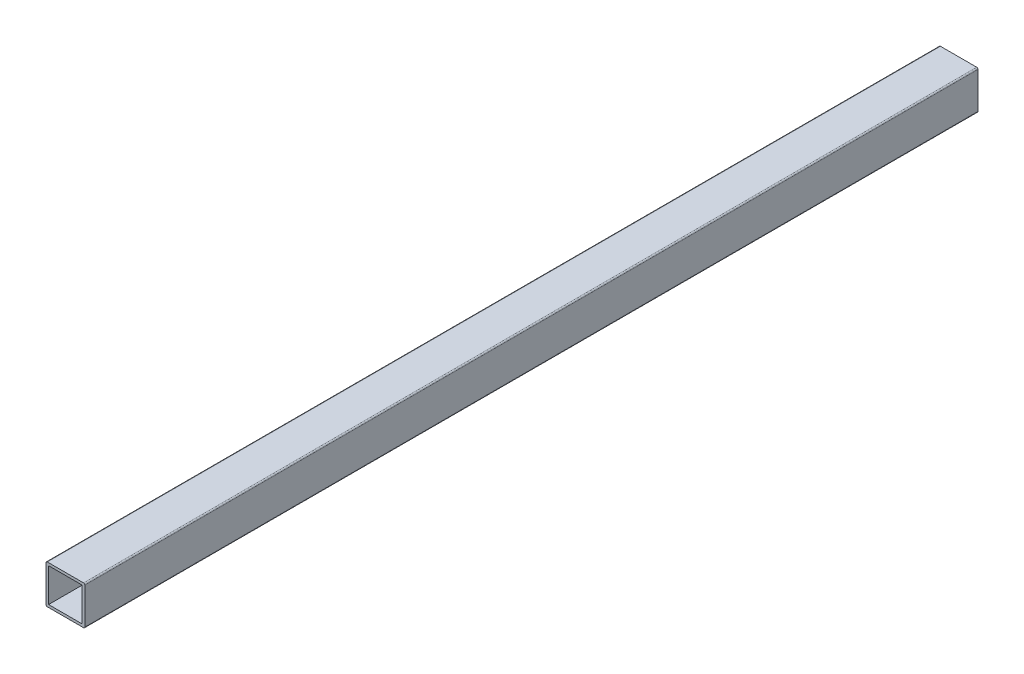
ISO-10303-21;
HEADER;
FILE_DESCRIPTION(('STEP AP214'),'2;1');
FILE_NAME('part.step','',(''),(''),'','','');
FILE_SCHEMA(('AUTOMOTIVE_DESIGN { 1 0 10303 214 1 1 1 1 }'));
ENDSEC;
DATA;
#1=APPLICATION_CONTEXT('core data for automotive mechanical design processes');
#2=APPLICATION_PROTOCOL_DEFINITION('international standard','automotive_design',2000,#1);
#3=PRODUCT_CONTEXT('',#1,'mechanical');
#4=PRODUCT('Part','Part','',(#3));
#5=PRODUCT_RELATED_PRODUCT_CATEGORY('part','',(#4));
#6=PRODUCT_DEFINITION_FORMATION('','',#4);
#7=PRODUCT_DEFINITION_CONTEXT('part definition',#1,'design');
#8=PRODUCT_DEFINITION('design','',#6,#7);
#9=PRODUCT_DEFINITION_SHAPE('','',#8);
#10=(LENGTH_UNIT() NAMED_UNIT(*) SI_UNIT(.MILLI.,.METRE.));
#11=(NAMED_UNIT(*) PLANE_ANGLE_UNIT() SI_UNIT($,.RADIAN.));
#12=(NAMED_UNIT(*) SI_UNIT($,.STERADIAN.) SOLID_ANGLE_UNIT());
#13=UNCERTAINTY_MEASURE_WITH_UNIT(LENGTH_MEASURE(1.E-05),#10,'distance_accuracy_value','');
#14=(GEOMETRIC_REPRESENTATION_CONTEXT(3) GLOBAL_UNCERTAINTY_ASSIGNED_CONTEXT((#13)) GLOBAL_UNIT_ASSIGNED_CONTEXT((#10,
#11,#12)) REPRESENTATION_CONTEXT('',''));
#15=CARTESIAN_POINT('',(0.,0.,0.));
#16=DIRECTION('',(0.,0.,1.));
#17=DIRECTION('',(1.,0.,0.));
#18=AXIS2_PLACEMENT_3D('',#15,#16,#17);
#19=CARTESIAN_POINT('',(-14.,-14.,690.));
#20=DIRECTION('',(0.,0.,-1.));
#21=DIRECTION('',(-1.,0.,0.));
#22=AXIS2_PLACEMENT_3D('',#19,#20,#21);
#23=PLANE('',#22);
#24=CARTESIAN_POINT('',(-14.,-14.,690.));
#25=DIRECTION('',(0.,0.,-1.));
#26=DIRECTION('',(-1.,0.,0.));
#27=AXIS2_PLACEMENT_3D('',#24,#25,#26);
#28=CIRCLE('',#27,0.999999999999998);
#29=CARTESIAN_POINT('',(-14.,-15.,690.));
#30=VERTEX_POINT('',#29);
#31=CARTESIAN_POINT('',(-15.,-14.,690.));
#32=VERTEX_POINT('',#31);
#33=EDGE_CURVE('E184',#30,#32,#28,.T.);
#34=ORIENTED_EDGE('',*,*,#33,.F.);
#35=DIRECTION('',(-1.,0.,0.));
#36=VECTOR('',#35,1.);
#37=CARTESIAN_POINT('',(14.,-15.,690.));
#38=LINE('',#37,#36);
#39=CARTESIAN_POINT('',(14.,-15.,690.));
#40=VERTEX_POINT('',#39);
#41=EDGE_CURVE('E202',#40,#30,#38,.T.);
#42=ORIENTED_EDGE('',*,*,#41,.F.);
#43=CARTESIAN_POINT('',(14.,-14.,690.));
#44=DIRECTION('',(0.,0.,-1.));
#45=DIRECTION('',(-1.,0.,0.));
#46=AXIS2_PLACEMENT_3D('',#43,#44,#45);
#47=CIRCLE('',#46,1.);
#48=CARTESIAN_POINT('',(15.,-14.,690.));
#49=VERTEX_POINT('',#48);
#50=EDGE_CURVE('E199',#49,#40,#47,.T.);
#51=ORIENTED_EDGE('',*,*,#50,.F.);
#52=DIRECTION('',(0.,1.,0.));
#53=VECTOR('',#52,1.);
#54=CARTESIAN_POINT('',(15.,-14.,690.));
#55=LINE('',#54,#53);
#56=CARTESIAN_POINT('',(15.,14.,690.));
#57=VERTEX_POINT('',#56);
#58=EDGE_CURVE('E197',#49,#57,#55,.T.);
#59=ORIENTED_EDGE('',*,*,#58,.T.);
#60=CARTESIAN_POINT('',(14.,14.,690.));
#61=DIRECTION('',(0.,0.,1.));
#62=DIRECTION('',(1.,0.,0.));
#63=AXIS2_PLACEMENT_3D('',#60,#61,#62);
#64=CIRCLE('',#63,0.999999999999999);
#65=CARTESIAN_POINT('',(14.,15.,690.));
#66=VERTEX_POINT('',#65);
#67=EDGE_CURVE('E195',#57,#66,#64,.T.);
#68=ORIENTED_EDGE('',*,*,#67,.T.);
#69=DIRECTION('',(1.,0.,0.));
#70=VECTOR('',#69,1.);
#71=CARTESIAN_POINT('',(-14.,15.,690.));
#72=LINE('',#71,#70);
#73=CARTESIAN_POINT('',(-14.,15.,690.));
#74=VERTEX_POINT('',#73);
#75=EDGE_CURVE('E192',#74,#66,#72,.T.);
#76=ORIENTED_EDGE('',*,*,#75,.F.);
#77=CARTESIAN_POINT('',(-14.,14.,690.));
#78=DIRECTION('',(0.,0.,-1.));
#79=DIRECTION('',(-1.,0.,0.));
#80=AXIS2_PLACEMENT_3D('',#77,#78,#79);
#81=CIRCLE('',#80,0.999999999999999);
#82=CARTESIAN_POINT('',(-15.,14.,690.));
#83=VERTEX_POINT('',#82);
#84=EDGE_CURVE('E189',#83,#74,#81,.T.);
#85=ORIENTED_EDGE('',*,*,#84,.F.);
#86=DIRECTION('',(0.,-1.,0.));
#87=VECTOR('',#86,1.);
#88=CARTESIAN_POINT('',(-15.,14.,690.));
#89=LINE('',#88,#87);
#90=EDGE_CURVE('E187',#83,#32,#89,.T.);
#91=ORIENTED_EDGE('',*,*,#90,.T.);
#92=EDGE_LOOP('',(#34,#42,#51,#59,#68,#76,#85,#91));
#93=FACE_BOUND('',#92,.T.);
#94=DIRECTION('',(0.,-1.,0.));
#95=VECTOR('',#94,1.);
#96=CARTESIAN_POINT('',(-13.,-14.,690.));
#97=LINE('',#96,#95);
#98=CARTESIAN_POINT('',(-13.,13.,690.));
#99=VERTEX_POINT('',#98);
#100=CARTESIAN_POINT('',(-13.,-13.,690.));
#101=VERTEX_POINT('',#100);
#102=EDGE_CURVE('E123',#99,#101,#97,.T.);
#103=ORIENTED_EDGE('',*,*,#102,.F.);
#104=DIRECTION('',(1.,0.,0.));
#105=VECTOR('',#104,1.);
#106=CARTESIAN_POINT('',(-14.,13.,690.));
#107=LINE('',#106,#105);
#108=CARTESIAN_POINT('',(13.,13.,690.));
#109=VERTEX_POINT('',#108);
#110=EDGE_CURVE('E155',#99,#109,#107,.T.);
#111=ORIENTED_EDGE('',*,*,#110,.T.);
#112=DIRECTION('',(0.,1.,0.));
#113=VECTOR('',#112,1.);
#114=CARTESIAN_POINT('',(13.,-14.,690.));
#115=LINE('',#114,#113);
#116=CARTESIAN_POINT('',(13.,-13.,690.));
#117=VERTEX_POINT('',#116);
#118=EDGE_CURVE('E153',#117,#109,#115,.T.);
#119=ORIENTED_EDGE('',*,*,#118,.F.);
#120=DIRECTION('',(-1.,0.,0.));
#121=VECTOR('',#120,1.);
#122=CARTESIAN_POINT('',(-14.,-13.,690.));
#123=LINE('',#122,#121);
#124=EDGE_CURVE('E151',#117,#101,#123,.T.);
#125=ORIENTED_EDGE('',*,*,#124,.T.);
#126=EDGE_LOOP('',(#103,#111,#119,#125));
#127=FACE_BOUND('',#126,.T.);
#128=ADVANCED_FACE('F30',(#93,#127),#23,.F.);
#129=CARTESIAN_POINT('',(-14.,-14.,0.));
#130=DIRECTION('',(0.,0.,-1.));
#131=DIRECTION('',(-1.,0.,0.));
#132=AXIS2_PLACEMENT_3D('',#129,#130,#131);
#133=PLANE('',#132);
#134=CARTESIAN_POINT('',(-14.,-14.,0.));
#135=DIRECTION('',(0.,0.,-1.));
#136=DIRECTION('',(-1.,0.,0.));
#137=AXIS2_PLACEMENT_3D('',#134,#135,#136);
#138=CIRCLE('',#137,0.999999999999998);
#139=CARTESIAN_POINT('',(-14.,-15.,0.));
#140=VERTEX_POINT('',#139);
#141=CARTESIAN_POINT('',(-15.,-14.,0.));
#142=VERTEX_POINT('',#141);
#143=EDGE_CURVE('E127',#140,#142,#138,.T.);
#144=ORIENTED_EDGE('',*,*,#143,.T.);
#145=DIRECTION('',(0.,-1.,0.));
#146=VECTOR('',#145,1.);
#147=CARTESIAN_POINT('',(-15.,14.,0.));
#148=LINE('',#147,#146);
#149=CARTESIAN_POINT('',(-15.,14.,0.));
#150=VERTEX_POINT('',#149);
#151=EDGE_CURVE('E164',#150,#142,#148,.T.);
#152=ORIENTED_EDGE('',*,*,#151,.F.);
#153=CARTESIAN_POINT('',(-14.,14.,0.));
#154=DIRECTION('',(0.,0.,-1.));
#155=DIRECTION('',(-1.,0.,0.));
#156=AXIS2_PLACEMENT_3D('',#153,#154,#155);
#157=CIRCLE('',#156,0.999999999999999);
#158=CARTESIAN_POINT('',(-14.,15.,0.));
#159=VERTEX_POINT('',#158);
#160=EDGE_CURVE('E167',#150,#159,#157,.T.);
#161=ORIENTED_EDGE('',*,*,#160,.T.);
#162=DIRECTION('',(1.,0.,0.));
#163=VECTOR('',#162,1.);
#164=CARTESIAN_POINT('',(-14.,15.,0.));
#165=LINE('',#164,#163);
#166=CARTESIAN_POINT('',(14.,15.,0.));
#167=VERTEX_POINT('',#166);
#168=EDGE_CURVE('E170',#159,#167,#165,.T.);
#169=ORIENTED_EDGE('',*,*,#168,.T.);
#170=CARTESIAN_POINT('',(14.,14.,0.));
#171=DIRECTION('',(0.,0.,1.));
#172=DIRECTION('',(1.,0.,0.));
#173=AXIS2_PLACEMENT_3D('',#170,#171,#172);
#174=CIRCLE('',#173,0.999999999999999);
#175=CARTESIAN_POINT('',(15.,14.,0.));
#176=VERTEX_POINT('',#175);
#177=EDGE_CURVE('E173',#176,#167,#174,.T.);
#178=ORIENTED_EDGE('',*,*,#177,.F.);
#179=DIRECTION('',(0.,1.,0.));
#180=VECTOR('',#179,1.);
#181=CARTESIAN_POINT('',(15.,-14.,0.));
#182=LINE('',#181,#180);
#183=CARTESIAN_POINT('',(15.,-14.,0.));
#184=VERTEX_POINT('',#183);
#185=EDGE_CURVE('E176',#184,#176,#182,.T.);
#186=ORIENTED_EDGE('',*,*,#185,.F.);
#187=CARTESIAN_POINT('',(14.,-14.,0.));
#188=DIRECTION('',(0.,0.,-1.));
#189=DIRECTION('',(-1.,0.,0.));
#190=AXIS2_PLACEMENT_3D('',#187,#188,#189);
#191=CIRCLE('',#190,1.);
#192=CARTESIAN_POINT('',(14.,-15.,0.));
#193=VERTEX_POINT('',#192);
#194=EDGE_CURVE('E178',#184,#193,#191,.T.);
#195=ORIENTED_EDGE('',*,*,#194,.T.);
#196=DIRECTION('',(-1.,0.,0.));
#197=VECTOR('',#196,1.);
#198=CARTESIAN_POINT('',(14.,-15.,0.));
#199=LINE('',#198,#197);
#200=EDGE_CURVE('E181',#193,#140,#199,.T.);
#201=ORIENTED_EDGE('',*,*,#200,.T.);
#202=EDGE_LOOP('',(#144,#152,#161,#169,#178,#186,#195,#201));
#203=FACE_BOUND('',#202,.T.);
#204=DIRECTION('',(1.,0.,0.));
#205=VECTOR('',#204,1.);
#206=CARTESIAN_POINT('',(-14.,13.,0.));
#207=LINE('',#206,#205);
#208=CARTESIAN_POINT('',(-13.,13.,0.));
#209=VERTEX_POINT('',#208);
#210=CARTESIAN_POINT('',(13.,13.,0.));
#211=VERTEX_POINT('',#210);
#212=EDGE_CURVE('E140',#209,#211,#207,.T.);
#213=ORIENTED_EDGE('',*,*,#212,.F.);
#214=DIRECTION('',(0.,-1.,0.));
#215=VECTOR('',#214,1.);
#216=CARTESIAN_POINT('',(-13.,-14.,0.));
#217=LINE('',#216,#215);
#218=CARTESIAN_POINT('',(-13.,-13.,0.));
#219=VERTEX_POINT('',#218);
#220=EDGE_CURVE('E55',#209,#219,#217,.T.);
#221=ORIENTED_EDGE('',*,*,#220,.T.);
#222=DIRECTION('',(-1.,0.,0.));
#223=VECTOR('',#222,1.);
#224=CARTESIAN_POINT('',(-14.,-13.,0.));
#225=LINE('',#224,#223);
#226=CARTESIAN_POINT('',(13.,-13.,0.));
#227=VERTEX_POINT('',#226);
#228=EDGE_CURVE('E131',#227,#219,#225,.T.);
#229=ORIENTED_EDGE('',*,*,#228,.F.);
#230=DIRECTION('',(0.,1.,0.));
#231=VECTOR('',#230,1.);
#232=CARTESIAN_POINT('',(13.,-14.,0.));
#233=LINE('',#232,#231);
#234=EDGE_CURVE('E136',#227,#211,#233,.T.);
#235=ORIENTED_EDGE('',*,*,#234,.T.);
#236=EDGE_LOOP('',(#213,#221,#229,#235));
#237=FACE_BOUND('',#236,.T.);
#238=ADVANCED_FACE('F139',(#203,#237),#133,.T.);
#239=CARTESIAN_POINT('',(-14.,-14.,690.));
#240=DIRECTION('',(0.,0.,-1.));
#241=DIRECTION('',(-1.,0.,0.));
#242=AXIS2_PLACEMENT_3D('',#239,#240,#241);
#243=CYLINDRICAL_SURFACE('',#242,0.999999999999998);
#244=ORIENTED_EDGE('',*,*,#143,.F.);
#245=DIRECTION('',(0.,0.,-1.));
#246=VECTOR('',#245,1.);
#247=CARTESIAN_POINT('',(-14.,-15.,690.));
#248=LINE('',#247,#246);
#249=EDGE_CURVE('E11',#30,#140,#248,.T.);
#250=ORIENTED_EDGE('',*,*,#249,.F.);
#251=ORIENTED_EDGE('',*,*,#33,.T.);
#252=DIRECTION('',(0.,0.,-1.));
#253=VECTOR('',#252,1.);
#254=CARTESIAN_POINT('',(-15.,-14.,690.));
#255=LINE('',#254,#253);
#256=EDGE_CURVE('E204',#32,#142,#255,.T.);
#257=ORIENTED_EDGE('',*,*,#256,.T.);
#258=EDGE_LOOP('',(#244,#250,#251,#257));
#259=FACE_BOUND('',#258,.T.);
#260=ADVANCED_FACE('F32',(#259),#243,.T.);
#261=CARTESIAN_POINT('',(14.,-15.,690.));
#262=DIRECTION('',(0.,-1.,0.));
#263=DIRECTION('',(1.,0.,0.));
#264=AXIS2_PLACEMENT_3D('',#261,#262,#263);
#265=PLANE('',#264);
#266=CARTESIAN_POINT('',(0.,-15.,45.));
#267=DIRECTION('',(0.,-1.,0.));
#268=DIRECTION('',(1.,0.,0.));
#269=AXIS2_PLACEMENT_3D('',#266,#267,#268);
#270=CIRCLE('',#269,5.);
#271=CARTESIAN_POINT('',(5.,-15.,45.));
#272=VERTEX_POINT('',#271);
#273=EDGE_CURVE('E234',#272,#272,#270,.T.);
#274=ORIENTED_EDGE('',*,*,#273,.F.);
#275=EDGE_LOOP('',(#274));
#276=FACE_BOUND('',#275,.T.);
#277=CARTESIAN_POINT('',(0.,-15.,190.));
#278=DIRECTION('',(0.,-1.,0.));
#279=DIRECTION('',(1.,0.,0.));
#280=AXIS2_PLACEMENT_3D('',#277,#278,#279);
#281=CIRCLE('',#280,5.);
#282=CARTESIAN_POINT('',(5.,-15.,190.));
#283=VERTEX_POINT('',#282);
#284=EDGE_CURVE('E224',#283,#283,#281,.T.);
#285=ORIENTED_EDGE('',*,*,#284,.F.);
#286=EDGE_LOOP('',(#285));
#287=FACE_BOUND('',#286,.T.);
#288=CARTESIAN_POINT('',(0.,-15.,500.));
#289=DIRECTION('',(0.,-1.,0.));
#290=DIRECTION('',(1.,0.,0.));
#291=AXIS2_PLACEMENT_3D('',#288,#289,#290);
#292=CIRCLE('',#291,5.00000000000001);
#293=CARTESIAN_POINT('',(5.00000000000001,-15.,500.));
#294=VERTEX_POINT('',#293);
#295=EDGE_CURVE('E221',#294,#294,#292,.T.);
#296=ORIENTED_EDGE('',*,*,#295,.F.);
#297=EDGE_LOOP('',(#296));
#298=FACE_BOUND('',#297,.T.);
#299=CARTESIAN_POINT('',(0.,-15.,645.));
#300=DIRECTION('',(0.,-1.,0.));
#301=DIRECTION('',(1.,0.,0.));
#302=AXIS2_PLACEMENT_3D('',#299,#300,#301);
#303=CIRCLE('',#302,5.00000000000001);
#304=CARTESIAN_POINT('',(5.00000000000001,-15.,645.));
#305=VERTEX_POINT('',#304);
#306=EDGE_CURVE('E144',#305,#305,#303,.T.);
#307=ORIENTED_EDGE('',*,*,#306,.F.);
#308=EDGE_LOOP('',(#307));
#309=FACE_BOUND('',#308,.T.);
#310=ORIENTED_EDGE('',*,*,#200,.F.);
#311=DIRECTION('',(0.,0.,-1.));
#312=VECTOR('',#311,1.);
#313=CARTESIAN_POINT('',(14.,-15.,690.));
#314=LINE('',#313,#312);
#315=EDGE_CURVE('E39',#40,#193,#314,.T.);
#316=ORIENTED_EDGE('',*,*,#315,.F.);
#317=ORIENTED_EDGE('',*,*,#41,.T.);
#318=ORIENTED_EDGE('',*,*,#249,.T.);
#319=EDGE_LOOP('',(#310,#316,#317,#318));
#320=FACE_BOUND('',#319,.T.);
#321=ADVANCED_FACE('F242',(#276,#287,#298,#309,#320),#265,.T.);
#322=CARTESIAN_POINT('',(14.,-14.,690.));
#323=DIRECTION('',(0.,0.,-1.));
#324=DIRECTION('',(-1.,0.,0.));
#325=AXIS2_PLACEMENT_3D('',#322,#323,#324);
#326=CYLINDRICAL_SURFACE('',#325,1.);
#327=ORIENTED_EDGE('',*,*,#194,.F.);
#328=DIRECTION('',(0.,0.,-1.));
#329=VECTOR('',#328,1.);
#330=CARTESIAN_POINT('',(15.,-14.,690.));
#331=LINE('',#330,#329);
#332=EDGE_CURVE('E207',#49,#184,#331,.T.);
#333=ORIENTED_EDGE('',*,*,#332,.F.);
#334=ORIENTED_EDGE('',*,*,#50,.T.);
#335=ORIENTED_EDGE('',*,*,#315,.T.);
#336=EDGE_LOOP('',(#327,#333,#334,#335));
#337=FACE_BOUND('',#336,.T.);
#338=ADVANCED_FACE('F245',(#337),#326,.T.);
#339=CARTESIAN_POINT('',(15.,-14.,690.));
#340=DIRECTION('',(-1.,0.,0.));
#341=DIRECTION('',(0.,-1.,0.));
#342=AXIS2_PLACEMENT_3D('',#339,#340,#341);
#343=PLANE('',#342);
#344=ORIENTED_EDGE('',*,*,#185,.T.);
#345=DIRECTION('',(0.,0.,-1.));
#346=VECTOR('',#345,1.);
#347=CARTESIAN_POINT('',(15.,14.,690.));
#348=LINE('',#347,#346);
#349=EDGE_CURVE('E209',#57,#176,#348,.T.);
#350=ORIENTED_EDGE('',*,*,#349,.F.);
#351=ORIENTED_EDGE('',*,*,#58,.F.);
#352=ORIENTED_EDGE('',*,*,#332,.T.);
#353=EDGE_LOOP('',(#344,#350,#351,#352));
#354=FACE_BOUND('',#353,.T.);
#355=ADVANCED_FACE('F281',(#354),#343,.F.);
#356=CARTESIAN_POINT('',(14.,14.,690.));
#357=DIRECTION('',(0.,0.,-1.));
#358=DIRECTION('',(-1.,0.,0.));
#359=AXIS2_PLACEMENT_3D('',#356,#357,#358);
#360=CYLINDRICAL_SURFACE('',#359,0.999999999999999);
#361=ORIENTED_EDGE('',*,*,#177,.T.);
#362=DIRECTION('',(0.,0.,-1.));
#363=VECTOR('',#362,1.);
#364=CARTESIAN_POINT('',(14.,15.,690.));
#365=LINE('',#364,#363);
#366=EDGE_CURVE('E212',#66,#167,#365,.T.);
#367=ORIENTED_EDGE('',*,*,#366,.F.);
#368=ORIENTED_EDGE('',*,*,#67,.F.);
#369=ORIENTED_EDGE('',*,*,#349,.T.);
#370=EDGE_LOOP('',(#361,#367,#368,#369));
#371=FACE_BOUND('',#370,.T.);
#372=ADVANCED_FACE('F277',(#371),#360,.T.);
#373=CARTESIAN_POINT('',(-14.,15.,690.));
#374=DIRECTION('',(0.,1.,0.));
#375=DIRECTION('',(0.,0.,1.));
#376=AXIS2_PLACEMENT_3D('',#373,#374,#375);
#377=PLANE('',#376);
#378=ORIENTED_EDGE('',*,*,#168,.F.);
#379=DIRECTION('',(0.,0.,-1.));
#380=VECTOR('',#379,1.);
#381=CARTESIAN_POINT('',(-14.,15.,690.));
#382=LINE('',#381,#380);
#383=EDGE_CURVE('E214',#74,#159,#382,.T.);
#384=ORIENTED_EDGE('',*,*,#383,.F.);
#385=ORIENTED_EDGE('',*,*,#75,.T.);
#386=ORIENTED_EDGE('',*,*,#366,.T.);
#387=EDGE_LOOP('',(#378,#384,#385,#386));
#388=FACE_BOUND('',#387,.T.);
#389=ADVANCED_FACE('F274',(#388),#377,.T.);
#390=CARTESIAN_POINT('',(-14.,14.,690.));
#391=DIRECTION('',(0.,0.,-1.));
#392=DIRECTION('',(-1.,0.,0.));
#393=AXIS2_PLACEMENT_3D('',#390,#391,#392);
#394=CYLINDRICAL_SURFACE('',#393,0.999999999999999);
#395=ORIENTED_EDGE('',*,*,#160,.F.);
#396=DIRECTION('',(0.,0.,-1.));
#397=VECTOR('',#396,1.);
#398=CARTESIAN_POINT('',(-15.,14.,690.));
#399=LINE('',#398,#397);
#400=EDGE_CURVE('E216',#83,#150,#399,.T.);
#401=ORIENTED_EDGE('',*,*,#400,.F.);
#402=ORIENTED_EDGE('',*,*,#84,.T.);
#403=ORIENTED_EDGE('',*,*,#383,.T.);
#404=EDGE_LOOP('',(#395,#401,#402,#403));
#405=FACE_BOUND('',#404,.T.);
#406=ADVANCED_FACE('F270',(#405),#394,.T.);
#407=CARTESIAN_POINT('',(-15.,14.,690.));
#408=DIRECTION('',(1.,0.,0.));
#409=DIRECTION('',(0.,1.,0.));
#410=AXIS2_PLACEMENT_3D('',#407,#408,#409);
#411=PLANE('',#410);
#412=ORIENTED_EDGE('',*,*,#151,.T.);
#413=ORIENTED_EDGE('',*,*,#256,.F.);
#414=ORIENTED_EDGE('',*,*,#90,.F.);
#415=ORIENTED_EDGE('',*,*,#400,.T.);
#416=EDGE_LOOP('',(#412,#413,#414,#415));
#417=FACE_BOUND('',#416,.T.);
#418=ADVANCED_FACE('F267',(#417),#411,.F.);
#419=CARTESIAN_POINT('',(-13.,-14.,690.));
#420=DIRECTION('',(1.,0.,0.));
#421=DIRECTION('',(0.,1.,0.));
#422=AXIS2_PLACEMENT_3D('',#419,#420,#421);
#423=PLANE('',#422);
#424=ORIENTED_EDGE('',*,*,#220,.F.);
#425=DIRECTION('',(0.,0.,-1.));
#426=VECTOR('',#425,1.);
#427=CARTESIAN_POINT('',(-13.,13.,690.));
#428=LINE('',#427,#426);
#429=EDGE_CURVE('E158',#99,#209,#428,.T.);
#430=ORIENTED_EDGE('',*,*,#429,.F.);
#431=ORIENTED_EDGE('',*,*,#102,.T.);
#432=DIRECTION('',(0.,0.,-1.));
#433=VECTOR('',#432,1.);
#434=CARTESIAN_POINT('',(-13.,-13.,690.));
#435=LINE('',#434,#433);
#436=EDGE_CURVE('E119',#101,#219,#435,.T.);
#437=ORIENTED_EDGE('',*,*,#436,.T.);
#438=EDGE_LOOP('',(#424,#430,#431,#437));
#439=FACE_BOUND('',#438,.T.);
#440=ADVANCED_FACE('F121',(#439),#423,.T.);
#441=CARTESIAN_POINT('',(-14.,-13.,690.));
#442=DIRECTION('',(0.,-1.,0.));
#443=DIRECTION('',(1.,0.,0.));
#444=AXIS2_PLACEMENT_3D('',#441,#442,#443);
#445=PLANE('',#444);
#446=CARTESIAN_POINT('',(0.,-13.,45.));
#447=DIRECTION('',(0.,-1.,0.));
#448=DIRECTION('',(1.,0.,0.));
#449=AXIS2_PLACEMENT_3D('',#446,#447,#448);
#450=CIRCLE('',#449,5.);
#451=CARTESIAN_POINT('',(5.,-13.,45.));
#452=VERTEX_POINT('',#451);
#453=EDGE_CURVE('E34',#452,#452,#450,.T.);
#454=ORIENTED_EDGE('',*,*,#453,.T.);
#455=EDGE_LOOP('',(#454));
#456=FACE_BOUND('',#455,.T.);
#457=CARTESIAN_POINT('',(0.,-13.,190.));
#458=DIRECTION('',(0.,-1.,0.));
#459=DIRECTION('',(1.,0.,0.));
#460=AXIS2_PLACEMENT_3D('',#457,#458,#459);
#461=CIRCLE('',#460,5.);
#462=CARTESIAN_POINT('',(5.,-13.,190.));
#463=VERTEX_POINT('',#462);
#464=EDGE_CURVE('E222',#463,#463,#461,.T.);
#465=ORIENTED_EDGE('',*,*,#464,.T.);
#466=EDGE_LOOP('',(#465));
#467=FACE_BOUND('',#466,.T.);
#468=CARTESIAN_POINT('',(0.,-13.,500.));
#469=DIRECTION('',(0.,-1.,0.));
#470=DIRECTION('',(1.,0.,0.));
#471=AXIS2_PLACEMENT_3D('',#468,#469,#470);
#472=CIRCLE('',#471,5.00000000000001);
#473=CARTESIAN_POINT('',(5.00000000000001,-13.,500.));
#474=VERTEX_POINT('',#473);
#475=EDGE_CURVE('E219',#474,#474,#472,.T.);
#476=ORIENTED_EDGE('',*,*,#475,.T.);
#477=EDGE_LOOP('',(#476));
#478=FACE_BOUND('',#477,.T.);
#479=CARTESIAN_POINT('',(0.,-13.,645.));
#480=DIRECTION('',(0.,-1.,0.));
#481=DIRECTION('',(1.,0.,0.));
#482=AXIS2_PLACEMENT_3D('',#479,#480,#481);
#483=CIRCLE('',#482,5.00000000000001);
#484=CARTESIAN_POINT('',(5.00000000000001,-13.,645.));
#485=VERTEX_POINT('',#484);
#486=EDGE_CURVE('E141',#485,#485,#483,.T.);
#487=ORIENTED_EDGE('',*,*,#486,.T.);
#488=EDGE_LOOP('',(#487));
#489=FACE_BOUND('',#488,.T.);
#490=ORIENTED_EDGE('',*,*,#228,.T.);
#491=ORIENTED_EDGE('',*,*,#436,.F.);
#492=ORIENTED_EDGE('',*,*,#124,.F.);
#493=DIRECTION('',(0.,0.,-1.));
#494=VECTOR('',#493,1.);
#495=CARTESIAN_POINT('',(13.,-13.,690.));
#496=LINE('',#495,#494);
#497=EDGE_CURVE('E128',#117,#227,#496,.T.);
#498=ORIENTED_EDGE('',*,*,#497,.T.);
#499=EDGE_LOOP('',(#490,#491,#492,#498));
#500=FACE_BOUND('',#499,.T.);
#501=ADVANCED_FACE('F132',(#456,#467,#478,#489,#500),#445,.F.);
#502=CARTESIAN_POINT('',(13.,-14.,690.));
#503=DIRECTION('',(-1.,0.,0.));
#504=DIRECTION('',(0.,-1.,0.));
#505=AXIS2_PLACEMENT_3D('',#502,#503,#504);
#506=PLANE('',#505);
#507=ORIENTED_EDGE('',*,*,#234,.F.);
#508=ORIENTED_EDGE('',*,*,#497,.F.);
#509=ORIENTED_EDGE('',*,*,#118,.T.);
#510=DIRECTION('',(0.,0.,-1.));
#511=VECTOR('',#510,1.);
#512=CARTESIAN_POINT('',(13.,13.,690.));
#513=LINE('',#512,#511);
#514=EDGE_CURVE('E47',#109,#211,#513,.T.);
#515=ORIENTED_EDGE('',*,*,#514,.T.);
#516=EDGE_LOOP('',(#507,#508,#509,#515));
#517=FACE_BOUND('',#516,.T.);
#518=ADVANCED_FACE('F301',(#517),#506,.T.);
#519=CARTESIAN_POINT('',(-14.,13.,690.));
#520=DIRECTION('',(0.,1.,0.));
#521=DIRECTION('',(0.,0.,1.));
#522=AXIS2_PLACEMENT_3D('',#519,#520,#521);
#523=PLANE('',#522);
#524=ORIENTED_EDGE('',*,*,#212,.T.);
#525=ORIENTED_EDGE('',*,*,#514,.F.);
#526=ORIENTED_EDGE('',*,*,#110,.F.);
#527=ORIENTED_EDGE('',*,*,#429,.T.);
#528=EDGE_LOOP('',(#524,#525,#526,#527));
#529=FACE_BOUND('',#528,.T.);
#530=ADVANCED_FACE('F305',(#529),#523,.F.);
#531=CARTESIAN_POINT('',(0.,-12.,645.));
#532=DIRECTION('',(0.,-1.,0.));
#533=DIRECTION('',(1.,0.,0.));
#534=AXIS2_PLACEMENT_3D('',#531,#532,#533);
#535=CYLINDRICAL_SURFACE('',#534,5.00000000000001);
#536=ORIENTED_EDGE('',*,*,#306,.T.);
#537=EDGE_LOOP('',(#536));
#538=FACE_BOUND('',#537,.T.);
#539=ORIENTED_EDGE('',*,*,#486,.F.);
#540=EDGE_LOOP('',(#539));
#541=FACE_BOUND('',#540,.T.);
#542=ADVANCED_FACE('F239',(#538,#541),#535,.F.);
#543=CARTESIAN_POINT('',(0.,-12.,500.));
#544=DIRECTION('',(0.,-1.,0.));
#545=DIRECTION('',(1.,0.,0.));
#546=AXIS2_PLACEMENT_3D('',#543,#544,#545);
#547=CYLINDRICAL_SURFACE('',#546,5.00000000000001);
#548=ORIENTED_EDGE('',*,*,#295,.T.);
#549=EDGE_LOOP('',(#548));
#550=FACE_BOUND('',#549,.T.);
#551=ORIENTED_EDGE('',*,*,#475,.F.);
#552=EDGE_LOOP('',(#551));
#553=FACE_BOUND('',#552,.T.);
#554=ADVANCED_FACE('F311',(#550,#553),#547,.F.);
#555=CARTESIAN_POINT('',(0.,-12.,190.));
#556=DIRECTION('',(0.,-1.,0.));
#557=DIRECTION('',(1.,0.,0.));
#558=AXIS2_PLACEMENT_3D('',#555,#556,#557);
#559=CYLINDRICAL_SURFACE('',#558,5.);
#560=ORIENTED_EDGE('',*,*,#284,.T.);
#561=EDGE_LOOP('',(#560));
#562=FACE_BOUND('',#561,.T.);
#563=ORIENTED_EDGE('',*,*,#464,.F.);
#564=EDGE_LOOP('',(#563));
#565=FACE_BOUND('',#564,.T.);
#566=ADVANCED_FACE('F314',(#562,#565),#559,.F.);
#567=CARTESIAN_POINT('',(0.,-12.,45.));
#568=DIRECTION('',(0.,-1.,0.));
#569=DIRECTION('',(1.,0.,0.));
#570=AXIS2_PLACEMENT_3D('',#567,#568,#569);
#571=CYLINDRICAL_SURFACE('',#570,5.);
#572=ORIENTED_EDGE('',*,*,#273,.T.);
#573=EDGE_LOOP('',(#572));
#574=FACE_BOUND('',#573,.T.);
#575=ORIENTED_EDGE('',*,*,#453,.F.);
#576=EDGE_LOOP('',(#575));
#577=FACE_BOUND('',#576,.T.);
#578=ADVANCED_FACE('F318',(#574,#577),#571,.F.);
#579=CLOSED_SHELL('',(#128,#238,#260,#321,#338,#355,#372,#389,#406,#418,#440,#501,#518,#530,
#542,#554,#566,#578));
#580=MANIFOLD_SOLID_BREP('B2',#579);
#581=ADVANCED_BREP_SHAPE_REPRESENTATION('',(#18,#580),#14);
#582=SHAPE_DEFINITION_REPRESENTATION(#9,#581);
ENDSEC;
END-ISO-10303-21;
